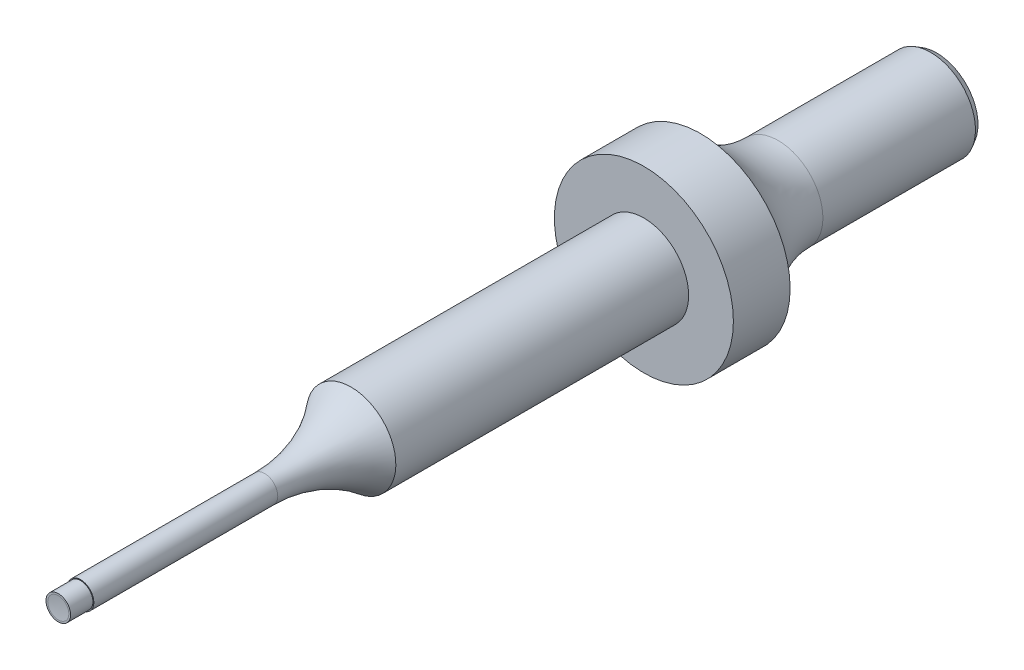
ISO-10303-21;
HEADER;
FILE_DESCRIPTION(('STEP AP214'),'2;1');
FILE_NAME('part.step','',(''),(''),'','','');
FILE_SCHEMA(('AUTOMOTIVE_DESIGN { 1 0 10303 214 1 1 1 1 }'));
ENDSEC;
DATA;
#1=APPLICATION_CONTEXT('core data for automotive mechanical design processes');
#2=APPLICATION_PROTOCOL_DEFINITION('international standard','automotive_design',2000,#1);
#3=PRODUCT_CONTEXT('',#1,'mechanical');
#4=PRODUCT('Part','Part','',(#3));
#5=PRODUCT_RELATED_PRODUCT_CATEGORY('part','',(#4));
#6=PRODUCT_DEFINITION_FORMATION('','',#4);
#7=PRODUCT_DEFINITION_CONTEXT('part definition',#1,'design');
#8=PRODUCT_DEFINITION('design','',#6,#7);
#9=PRODUCT_DEFINITION_SHAPE('','',#8);
#10=(LENGTH_UNIT() NAMED_UNIT(*) SI_UNIT(.MILLI.,.METRE.));
#11=(NAMED_UNIT(*) PLANE_ANGLE_UNIT() SI_UNIT($,.RADIAN.));
#12=(NAMED_UNIT(*) SI_UNIT($,.STERADIAN.) SOLID_ANGLE_UNIT());
#13=UNCERTAINTY_MEASURE_WITH_UNIT(LENGTH_MEASURE(1.E-05),#10,'distance_accuracy_value','');
#14=(GEOMETRIC_REPRESENTATION_CONTEXT(3) GLOBAL_UNCERTAINTY_ASSIGNED_CONTEXT((#13)) GLOBAL_UNIT_ASSIGNED_CONTEXT((#10,
#11,#12)) REPRESENTATION_CONTEXT('',''));
#15=CARTESIAN_POINT('',(0.,0.,0.));
#16=DIRECTION('',(0.,0.,1.));
#17=DIRECTION('',(1.,0.,0.));
#18=AXIS2_PLACEMENT_3D('',#15,#16,#17);
#19=CARTESIAN_POINT('',(0.,0.,-100.));
#20=DIRECTION('',(0.,0.,1.));
#21=DIRECTION('',(1.,0.,0.));
#22=AXIS2_PLACEMENT_3D('',#19,#20,#21);
#23=CYLINDRICAL_SURFACE('',#22,5.095);
#24=CARTESIAN_POINT('',(0.,0.,-33.3333333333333));
#25=DIRECTION('',(0.,0.,-1.));
#26=DIRECTION('',(0.,1.,0.));
#27=AXIS2_PLACEMENT_3D('',#24,#25,#26);
#28=CIRCLE('',#27,5.095);
#29=CARTESIAN_POINT('',(0.,5.095,-33.3333333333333));
#30=VERTEX_POINT('',#29);
#31=EDGE_CURVE('E76',#30,#30,#28,.T.);
#32=ORIENTED_EDGE('',*,*,#31,.T.);
#33=EDGE_LOOP('',(#32));
#34=FACE_BOUND('',#33,.T.);
#35=CARTESIAN_POINT('',(0.,0.,-66.6666666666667));
#36=DIRECTION('',(0.,0.,-1.));
#37=DIRECTION('',(-1.,0.,0.));
#38=AXIS2_PLACEMENT_3D('',#35,#36,#37);
#39=CIRCLE('',#38,5.095);
#40=CARTESIAN_POINT('',(-5.095,0.,-66.6666666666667));
#41=VERTEX_POINT('',#40);
#42=EDGE_CURVE('E44',#41,#41,#39,.F.);
#43=ORIENTED_EDGE('',*,*,#42,.T.);
#44=EDGE_LOOP('',(#43));
#45=FACE_BOUND('',#44,.T.);
#46=ADVANCED_FACE('F40',(#34,#45),#23,.T.);
#47=CARTESIAN_POINT('',(0.,0.,-33.3333333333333));
#48=DIRECTION('',(0.,0.,1.));
#49=DIRECTION('',(1.,0.,0.));
#50=AXIS2_PLACEMENT_3D('',#47,#48,#49);
#51=CYLINDRICAL_SURFACE('',#50,1.5);
#52=CARTESIAN_POINT('',(0.,0.,-23.485738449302));
#53=DIRECTION('',(0.,0.,1.));
#54=DIRECTION('',(0.,-1.,0.));
#55=AXIS2_PLACEMENT_3D('',#52,#53,#54);
#56=CIRCLE('',#55,1.5);
#57=CARTESIAN_POINT('',(0.,-1.5,-23.485738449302));
#58=VERTEX_POINT('',#57);
#59=EDGE_CURVE('E12',#58,#58,#56,.F.);
#60=ORIENTED_EDGE('',*,*,#59,.F.);
#61=EDGE_LOOP('',(#60));
#62=FACE_BOUND('',#61,.T.);
#63=CARTESIAN_POINT('',(0.,0.,-2.5475));
#64=DIRECTION('',(0.,0.,1.));
#65=DIRECTION('',(1.,0.,0.));
#66=AXIS2_PLACEMENT_3D('',#63,#64,#65);
#67=CIRCLE('',#66,1.5);
#68=CARTESIAN_POINT('',(1.5,0.,-2.5475));
#69=VERTEX_POINT('',#68);
#70=EDGE_CURVE('E60',#69,#69,#67,.F.);
#71=ORIENTED_EDGE('',*,*,#70,.T.);
#72=EDGE_LOOP('',(#71));
#73=FACE_BOUND('',#72,.T.);
#74=ADVANCED_FACE('F105',(#62,#73),#51,.T.);
#75=CARTESIAN_POINT('',(0.,0.,-2.5475));
#76=DIRECTION('',(0.,0.,1.));
#77=DIRECTION('',(1.,0.,0.));
#78=AXIS2_PLACEMENT_3D('',#75,#76,#77);
#79=PLANE('',#78);
#80=ORIENTED_EDGE('',*,*,#70,.F.);
#81=EDGE_LOOP('',(#80));
#82=FACE_BOUND('',#81,.T.);
#83=CARTESIAN_POINT('',(0.,0.,-2.5475));
#84=DIRECTION('',(0.,0.,1.));
#85=DIRECTION('',(1.,0.,0.));
#86=AXIS2_PLACEMENT_3D('',#83,#84,#85);
#87=CIRCLE('',#86,1.4);
#88=CARTESIAN_POINT('',(1.4,0.,-2.5475));
#89=VERTEX_POINT('',#88);
#90=EDGE_CURVE('E64',#89,#89,#87,.T.);
#91=ORIENTED_EDGE('',*,*,#90,.F.);
#92=EDGE_LOOP('',(#91));
#93=FACE_BOUND('',#92,.T.);
#94=ADVANCED_FACE('F110',(#82,#93),#79,.T.);
#95=CARTESIAN_POINT('',(0.,0.,-2.5475));
#96=DIRECTION('',(0.,0.,1.));
#97=DIRECTION('',(1.,0.,0.));
#98=AXIS2_PLACEMENT_3D('',#95,#96,#97);
#99=CYLINDRICAL_SURFACE('',#98,1.4);
#100=CARTESIAN_POINT('',(0.,0.,0.));
#101=DIRECTION('',(0.,0.,1.));
#102=DIRECTION('',(1.,0.,0.));
#103=AXIS2_PLACEMENT_3D('',#100,#101,#102);
#104=CIRCLE('',#103,1.4);
#105=CARTESIAN_POINT('',(1.4,0.,0.));
#106=VERTEX_POINT('',#105);
#107=EDGE_CURVE('E65',#106,#106,#104,.T.);
#108=CARTESIAN_POINT('',(1.4,0.,-2.5475));
#109=CARTESIAN_POINT('',(1.4,0.,-2.52096354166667));
#110=CARTESIAN_POINT('',(1.4,0.,-2.49442708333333));
#111=CARTESIAN_POINT('',(1.4,0.,-2.44135416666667));
#112=CARTESIAN_POINT('',(1.4,0.,-2.41481770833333));
#113=CARTESIAN_POINT('',(1.4,0.,-2.36174479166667));
#114=CARTESIAN_POINT('',(1.4,0.,-2.33520833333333));
#115=CARTESIAN_POINT('',(1.4,0.,-2.28213541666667));
#116=CARTESIAN_POINT('',(1.4,0.,-2.25559895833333));
#117=CARTESIAN_POINT('',(1.4,0.,-2.20252604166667));
#118=CARTESIAN_POINT('',(1.4,0.,-2.17598958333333));
#119=CARTESIAN_POINT('',(1.4,0.,-2.12291666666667));
#120=CARTESIAN_POINT('',(1.4,0.,-2.09638020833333));
#121=CARTESIAN_POINT('',(1.4,0.,-2.04330729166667));
#122=CARTESIAN_POINT('',(1.4,0.,-2.01677083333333));
#123=CARTESIAN_POINT('',(1.4,0.,-1.96369791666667));
#124=CARTESIAN_POINT('',(1.4,0.,-1.93716145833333));
#125=CARTESIAN_POINT('',(1.4,0.,-1.88408854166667));
#126=CARTESIAN_POINT('',(1.4,0.,-1.85755208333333));
#127=CARTESIAN_POINT('',(1.4,0.,-1.80447916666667));
#128=CARTESIAN_POINT('',(1.4,0.,-1.77794270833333));
#129=CARTESIAN_POINT('',(1.4,0.,-1.72486979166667));
#130=CARTESIAN_POINT('',(1.4,0.,-1.69833333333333));
#131=CARTESIAN_POINT('',(1.4,0.,-1.64526041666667));
#132=CARTESIAN_POINT('',(1.4,0.,-1.61872395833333));
#133=CARTESIAN_POINT('',(1.4,0.,-1.56565104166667));
#134=CARTESIAN_POINT('',(1.4,0.,-1.53911458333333));
#135=CARTESIAN_POINT('',(1.4,0.,-1.48604166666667));
#136=CARTESIAN_POINT('',(1.4,0.,-1.45950520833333));
#137=CARTESIAN_POINT('',(1.4,0.,-1.40643229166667));
#138=CARTESIAN_POINT('',(1.4,0.,-1.37989583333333));
#139=CARTESIAN_POINT('',(1.4,0.,-1.32682291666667));
#140=CARTESIAN_POINT('',(1.4,0.,-1.30028645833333));
#141=CARTESIAN_POINT('',(1.4,0.,-1.24721354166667));
#142=CARTESIAN_POINT('',(1.4,0.,-1.22067708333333));
#143=CARTESIAN_POINT('',(1.4,0.,-1.16760416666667));
#144=CARTESIAN_POINT('',(1.4,0.,-1.14106770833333));
#145=CARTESIAN_POINT('',(1.4,0.,-1.08799479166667));
#146=CARTESIAN_POINT('',(1.4,0.,-1.06145833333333));
#147=CARTESIAN_POINT('',(1.4,0.,-1.00838541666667));
#148=CARTESIAN_POINT('',(1.4,0.,-0.981848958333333));
#149=CARTESIAN_POINT('',(1.4,0.,-0.928776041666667));
#150=CARTESIAN_POINT('',(1.4,0.,-0.902239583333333));
#151=CARTESIAN_POINT('',(1.4,0.,-0.849166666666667));
#152=CARTESIAN_POINT('',(1.4,0.,-0.822630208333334));
#153=CARTESIAN_POINT('',(1.4,0.,-0.769557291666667));
#154=CARTESIAN_POINT('',(1.4,0.,-0.743020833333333));
#155=CARTESIAN_POINT('',(1.4,0.,-0.689947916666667));
#156=CARTESIAN_POINT('',(1.4,0.,-0.663411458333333));
#157=CARTESIAN_POINT('',(1.4,0.,-0.610338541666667));
#158=CARTESIAN_POINT('',(1.4,0.,-0.583802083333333));
#159=CARTESIAN_POINT('',(1.4,0.,-0.530729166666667));
#160=CARTESIAN_POINT('',(1.4,0.,-0.504192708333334));
#161=CARTESIAN_POINT('',(1.4,0.,-0.451119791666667));
#162=CARTESIAN_POINT('',(1.4,0.,-0.424583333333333));
#163=CARTESIAN_POINT('',(1.4,0.,-0.371510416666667));
#164=CARTESIAN_POINT('',(1.4,0.,-0.344973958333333));
#165=CARTESIAN_POINT('',(1.4,0.,-0.291901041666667));
#166=CARTESIAN_POINT('',(1.4,0.,-0.265364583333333));
#167=CARTESIAN_POINT('',(1.4,0.,-0.212291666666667));
#168=CARTESIAN_POINT('',(1.4,0.,-0.185755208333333));
#169=CARTESIAN_POINT('',(1.4,0.,-0.132682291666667));
#170=CARTESIAN_POINT('',(1.4,0.,-0.106145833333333));
#171=CARTESIAN_POINT('',(1.4,0.,-0.0530729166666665));
#172=CARTESIAN_POINT('',(1.4,0.,-0.0265364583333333));
#173=CARTESIAN_POINT('',(1.4,0.,0.));
#174=B_SPLINE_CURVE_WITH_KNOTS('',3,(#108,#109,#110,#111,#112,#113,#114,#115,#116,#117,#118,
#119,#120,#121,#122,#123,#124,#125,#126,#127,#128,#129,#130,#131,#132,#133,#134,#135,#136,#137,
#138,#139,#140,#141,#142,#143,#144,#145,#146,#147,#148,#149,#150,#151,#152,#153,#154,#155,#156,
#157,#158,#159,#160,#161,#162,#163,#164,#165,#166,#167,#168,#169,#170,#171,#172,#173),
.UNSPECIFIED.,.F.,.F.,(4,2,2,2,2,2,2,2,2,2,2,2,2,2,2,2,2,2,2,2,2,2,2,2,2,2,2,2,2,2,2,2,4),(0.,
0.0796093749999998,0.15921875,0.238828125,0.3184375,0.398046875,0.47765625,0.557265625,0.636875,
0.716484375,0.79609375,0.875703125,0.9553125,1.034921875,1.11453125,1.194140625,1.27375,
1.353359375,1.43296875,1.512578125,1.5921875,1.671796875,1.75140625,1.831015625,1.910625,
1.990234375,2.06984375,2.149453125,2.2290625,2.308671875,2.38828125,2.467890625,2.5475),.UNSPECIFIED.);
#175=EDGE_CURVE('BSEAM147',#89,#106,#174,.T.);
#176=ORIENTED_EDGE('',*,*,#90,.T.);
#177=ORIENTED_EDGE('',*,*,#107,.F.);
#178=ORIENTED_EDGE('',*,*,#175,.T.);
#179=ORIENTED_EDGE('',*,*,#175,.F.);
#180=EDGE_LOOP('',(#176,#178,#177,#179));
#181=FACE_BOUND('',#180,.T.);
#182=ADVANCED_FACE('F147',(#181),#99,.T.);
#183=CARTESIAN_POINT('',(0.,0.,0.));
#184=DIRECTION('',(0.,0.,1.));
#185=DIRECTION('',(1.,0.,0.));
#186=AXIS2_PLACEMENT_3D('',#183,#184,#185);
#187=PLANE('',#186);
#188=CARTESIAN_POINT('',(0.,0.,0.));
#189=DIRECTION('',(0.,0.,1.));
#190=DIRECTION('',(0.,-1.,0.));
#191=AXIS2_PLACEMENT_3D('',#188,#189,#190);
#192=CIRCLE('',#191,1.2);
#193=CARTESIAN_POINT('',(0.,-1.2,0.));
#194=VERTEX_POINT('',#193);
#195=EDGE_CURVE('E69',#194,#194,#192,.T.);
#196=ORIENTED_EDGE('',*,*,#195,.F.);
#197=EDGE_LOOP('',(#196));
#198=FACE_BOUND('',#197,.T.);
#199=ORIENTED_EDGE('',*,*,#107,.T.);
#200=EDGE_LOOP('',(#199));
#201=FACE_BOUND('',#200,.T.);
#202=ADVANCED_FACE('F145',(#198,#201),#187,.T.);
#203=CARTESIAN_POINT('',(0.,0.,10.1190958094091));
#204=DIRECTION('',(0.,0.,1.));
#205=DIRECTION('',(0.,-1.,0.));
#206=AXIS2_PLACEMENT_3D('',#203,#204,#205);
#207=SPHERICAL_SURFACE('',#206,10.19);
#208=ORIENTED_EDGE('',*,*,#195,.T.);
#209=EDGE_LOOP('',(#208));
#210=FACE_BOUND('',#209,.T.);
#211=ADVANCED_FACE('F142',(#210),#207,.F.);
#212=CARTESIAN_POINT('',(0.,0.,-23.485738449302));
#213=DIRECTION('',(0.,0.,-1.));
#214=DIRECTION('',(0.,1.,0.));
#215=AXIS2_PLACEMENT_3D('',#212,#213,#214);
#216=TOROIDAL_SURFACE('',#215,16.785,15.285);
#217=ORIENTED_EDGE('',*,*,#59,.T.);
#218=EDGE_LOOP('',(#217));
#219=FACE_BOUND('',#218,.T.);
#220=ORIENTED_EDGE('',*,*,#31,.F.);
#221=EDGE_LOOP('',(#220));
#222=FACE_BOUND('',#221,.T.);
#223=ADVANCED_FACE('F123',(#219,#222),#216,.F.);
#224=CARTESIAN_POINT('',(0.,0.,-66.6666666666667));
#225=DIRECTION('',(0.,0.,-1.));
#226=DIRECTION('',(-1.,0.,0.));
#227=AXIS2_PLACEMENT_3D('',#224,#225,#226);
#228=PLANE('',#227);
#229=ORIENTED_EDGE('',*,*,#42,.F.);
#230=EDGE_LOOP('',(#229));
#231=FACE_BOUND('',#230,.T.);
#232=CARTESIAN_POINT('',(0.,0.,-66.6666666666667));
#233=DIRECTION('',(0.,0.,1.));
#234=DIRECTION('',(1.,0.,0.));
#235=AXIS2_PLACEMENT_3D('',#232,#233,#234);
#236=CIRCLE('',#235,10.19);
#237=CARTESIAN_POINT('',(10.19,0.,-66.6666666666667));
#238=VERTEX_POINT('',#237);
#239=EDGE_CURVE('E80',#238,#238,#236,.T.);
#240=ORIENTED_EDGE('',*,*,#239,.T.);
#241=EDGE_LOOP('',(#240));
#242=FACE_BOUND('',#241,.T.);
#243=ADVANCED_FACE('F119',(#231,#242),#228,.F.);
#244=CARTESIAN_POINT('',(0.,0.,-66.6666666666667));
#245=DIRECTION('',(0.,0.,1.));
#246=DIRECTION('',(1.,0.,0.));
#247=AXIS2_PLACEMENT_3D('',#244,#245,#246);
#248=CYLINDRICAL_SURFACE('',#247,10.19);
#249=ORIENTED_EDGE('',*,*,#239,.F.);
#250=EDGE_LOOP('',(#249));
#251=FACE_BOUND('',#250,.T.);
#252=CARTESIAN_POINT('',(0.,0.,-73.1268678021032));
#253=DIRECTION('',(0.,0.,1.));
#254=DIRECTION('',(1.,0.,0.));
#255=AXIS2_PLACEMENT_3D('',#252,#253,#254);
#256=CIRCLE('',#255,10.19);
#257=CARTESIAN_POINT('',(10.19,0.,-73.1268678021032));
#258=VERTEX_POINT('',#257);
#259=EDGE_CURVE('E84',#258,#258,#256,.T.);
#260=ORIENTED_EDGE('',*,*,#259,.T.);
#261=EDGE_LOOP('',(#260));
#262=FACE_BOUND('',#261,.T.);
#263=ADVANCED_FACE('F122',(#251,#262),#248,.T.);
#264=CARTESIAN_POINT('',(0.,0.,-81.9516666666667));
#265=DIRECTION('',(0.,0.,1.));
#266=DIRECTION('',(1.,0.,0.));
#267=AXIS2_PLACEMENT_3D('',#264,#265,#266);
#268=TOROIDAL_SURFACE('',#267,15.285,10.19);
#269=ORIENTED_EDGE('',*,*,#259,.F.);
#270=EDGE_LOOP('',(#269));
#271=FACE_BOUND('',#270,.T.);
#272=CARTESIAN_POINT('',(0.,0.,-81.9516666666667));
#273=DIRECTION('',(0.,0.,1.));
#274=DIRECTION('',(1.,0.,0.));
#275=AXIS2_PLACEMENT_3D('',#272,#273,#274);
#276=CIRCLE('',#275,5.095);
#277=CARTESIAN_POINT('',(5.095,0.,-81.9516666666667));
#278=VERTEX_POINT('',#277);
#279=EDGE_CURVE('E88',#278,#278,#276,.T.);
#280=ORIENTED_EDGE('',*,*,#279,.T.);
#281=EDGE_LOOP('',(#280));
#282=FACE_BOUND('',#281,.T.);
#283=ADVANCED_FACE('F93',(#271,#282),#268,.F.);
#284=CARTESIAN_POINT('',(0.,0.,-100.));
#285=DIRECTION('',(0.,0.,1.));
#286=DIRECTION('',(1.,0.,0.));
#287=AXIS2_PLACEMENT_3D('',#284,#285,#286);
#288=PLANE('',#287);
#289=CARTESIAN_POINT('',(0.,0.,-100.));
#290=DIRECTION('',(0.,0.,1.));
#291=DIRECTION('',(1.,0.,0.));
#292=AXIS2_PLACEMENT_3D('',#289,#290,#291);
#293=CIRCLE('',#292,4.70278671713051);
#294=CARTESIAN_POINT('',(4.70278671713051,0.,-100.));
#295=VERTEX_POINT('',#294);
#296=EDGE_CURVE('E49',#295,#295,#293,.F.);
#297=ORIENTED_EDGE('',*,*,#296,.T.);
#298=EDGE_LOOP('',(#297));
#299=FACE_BOUND('',#298,.T.);
#300=ADVANCED_FACE('F101',(#299),#288,.F.);
#301=CARTESIAN_POINT('',(0.,0.,-99.3206666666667));
#302=DIRECTION('',(0.,0.,1.));
#303=DIRECTION('',(1.,0.,0.));
#304=AXIS2_PLACEMENT_3D('',#301,#302,#303);
#305=CONICAL_SURFACE('',#304,5.095,0.523598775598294);
#306=ORIENTED_EDGE('',*,*,#296,.F.);
#307=EDGE_LOOP('',(#306));
#308=FACE_BOUND('',#307,.T.);
#309=CARTESIAN_POINT('',(0.,0.,-99.3206666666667));
#310=DIRECTION('',(0.,0.,1.));
#311=DIRECTION('',(1.,0.,0.));
#312=AXIS2_PLACEMENT_3D('',#309,#310,#311);
#313=CIRCLE('',#312,5.095);
#314=CARTESIAN_POINT('',(5.095,0.,-99.3206666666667));
#315=VERTEX_POINT('',#314);
#316=EDGE_CURVE('E54',#315,#315,#313,.T.);
#317=ORIENTED_EDGE('',*,*,#316,.F.);
#318=EDGE_LOOP('',(#317));
#319=FACE_BOUND('',#318,.T.);
#320=ADVANCED_FACE('F42',(#308,#319),#305,.T.);
#321=ORIENTED_EDGE('',*,*,#316,.T.);
#322=EDGE_LOOP('',(#321));
#323=FACE_BOUND('',#322,.T.);
#324=ORIENTED_EDGE('',*,*,#279,.F.);
#325=EDGE_LOOP('',(#324));
#326=FACE_BOUND('',#325,.T.);
#327=ADVANCED_FACE('F95',(#323,#326),#23,.T.);
#328=CLOSED_SHELL('',(#46,#74,#94,#182,#202,#211,#223,#243,#263,#283,#300,#320,#327));
#329=MANIFOLD_SOLID_BREP('B2',#328);
#330=ADVANCED_BREP_SHAPE_REPRESENTATION('',(#18,#329),#14);
#331=SHAPE_DEFINITION_REPRESENTATION(#9,#330);
ENDSEC;
END-ISO-10303-21;
